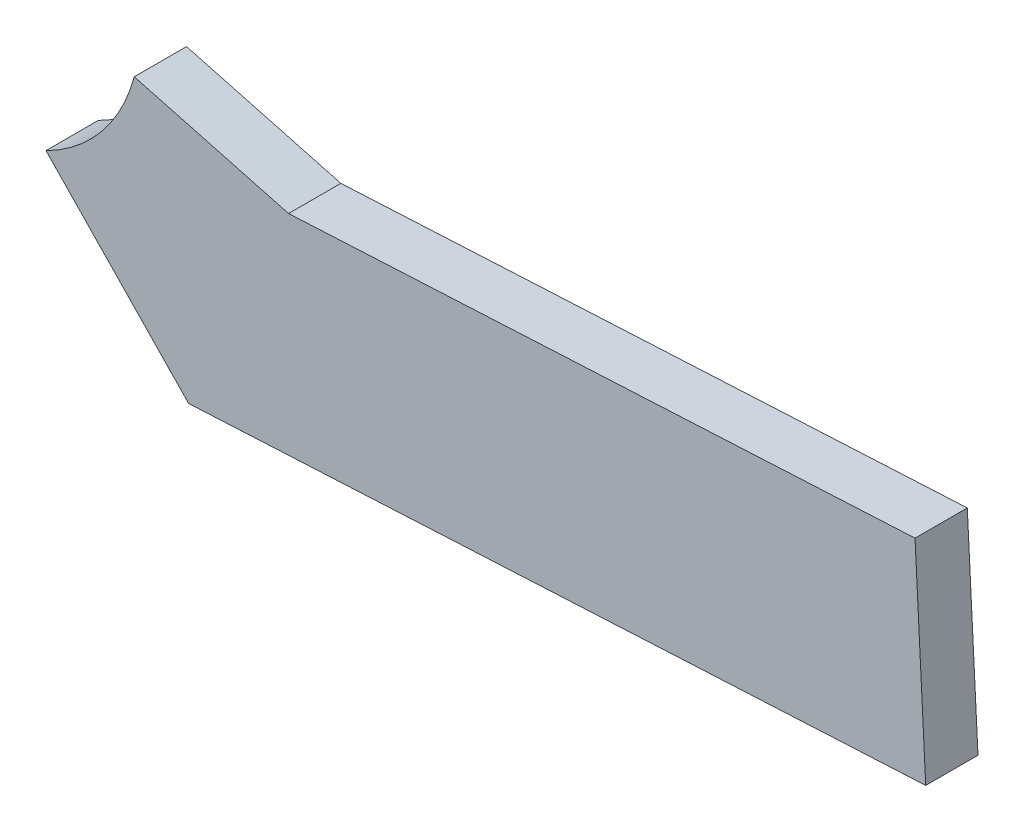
from build123d import *

# Parameters (mm, degrees)
EXTRUDE1_DEPTH      = 3.175
EXTRUDE1_DEPTH_BACK = 3.175


with BuildPart() as part:
    # Sketch1 → Extrude1 (new, two sides: drawn at the far end of the back side and taken through both)
    with BuildSketch(Plane(origin=(246.482371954, 13.152366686, 3.175), x_dir=(0.051208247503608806, -0.998687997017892, 0), z_dir=(0, 0, 1)).offset(-EXTRUDE1_DEPTH_BACK)):
        with BuildLine():
            Line((6.35, 19.636290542), (12.320809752, 38.1))
            Line((12.320809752, 38.1), (12.320809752, 114.3))
            Line((12.320809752, 114.3), (37.720809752, 114.3))
            Line((37.720809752, 114.3), (37.720809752, 24.638))
            Line((37.720809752, 24.638), (18.914458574, 8.255280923))
            ThreePointArc((18.914458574, 8.255280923), (13.854784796, 15.295468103), (6.35, 19.636290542))
        make_face()
    extrude(amount=EXTRUDE1_DEPTH + EXTRUDE1_DEPTH_BACK)


solid = part.part
